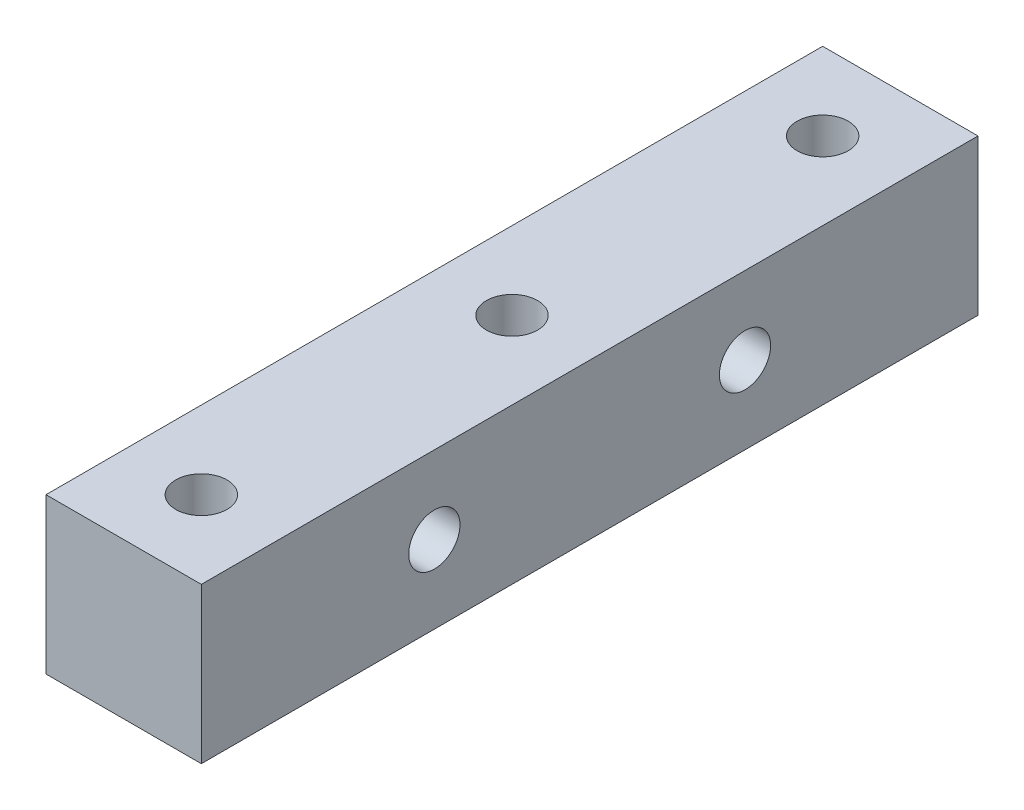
from build123d import *

# Parameters (mm, degrees)
SKETCH_1_W         = 10
SKETCH_1_H         = 10
EXTRUDE_1_DEPTH    = 50
HOLE_WIZARD_M4_1_D = 3.3
HOLE_WIZARD_M4_2_D = 3.3


with BuildPart() as part:
    # Sketch 1 → Extrude 1 (new body)
    with BuildSketch(Plane.XY):
        Rectangle(SKETCH_1_W, SKETCH_1_H)
    extrude(amount=EXTRUDE_1_DEPTH)

    # Hole Wizard M4 _1 (through all)
    with Locations(Plane(origin=(0, 5, 0), x_dir=(1, 0, 0), z_dir=(0, 1, 0))):
        with Locations((0, -5), (0, -25), (0, -45)):
            Hole(HOLE_WIZARD_M4_1_D / 2)

    # Hole Wizard M4 _2 (through all)
    with Locations(Plane(origin=(5, 0, 0), x_dir=(0, 0, -1), z_dir=(1, 0, 0))):
        with Locations((-35, 0), (-15, 0)):
            Hole(HOLE_WIZARD_M4_2_D / 2)


solid = part.part
